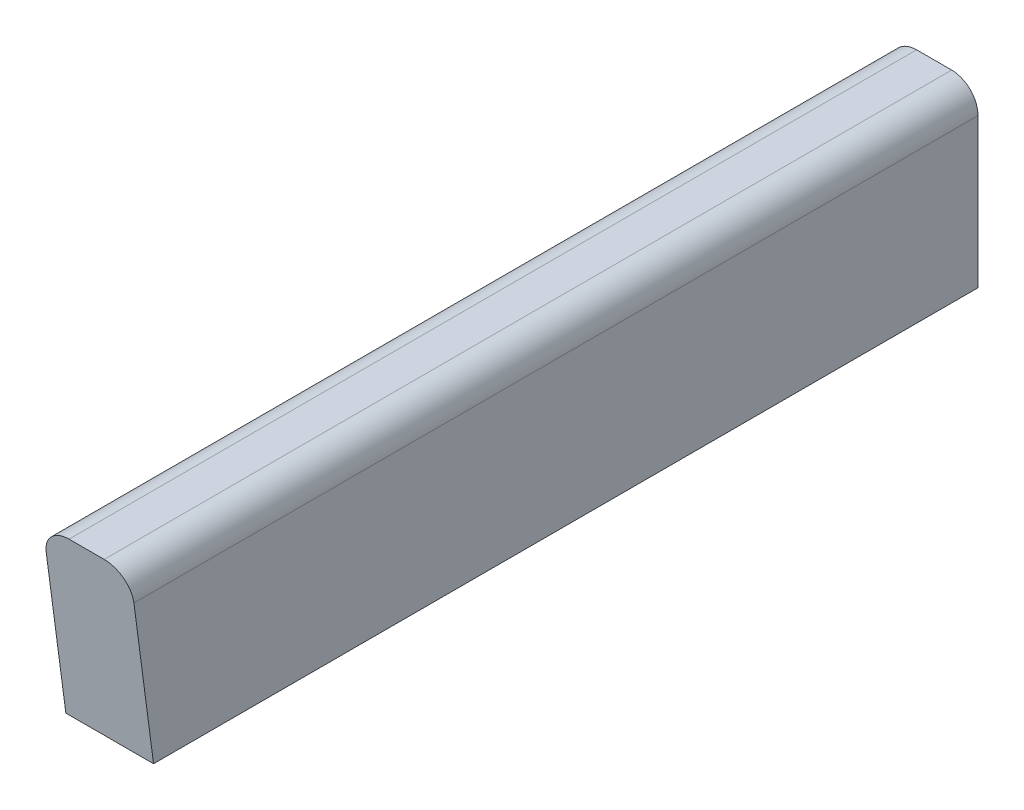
ISO-10303-21;
HEADER;
FILE_DESCRIPTION(('STEP AP214'),'2;1');
FILE_NAME('part.step','',(''),(''),'','','');
FILE_SCHEMA(('AUTOMOTIVE_DESIGN { 1 0 10303 214 1 1 1 1 }'));
ENDSEC;
DATA;
#1=APPLICATION_CONTEXT('core data for automotive mechanical design processes');
#2=APPLICATION_PROTOCOL_DEFINITION('international standard','automotive_design',2000,#1);
#3=PRODUCT_CONTEXT('',#1,'mechanical');
#4=PRODUCT('Part','Part','',(#3));
#5=PRODUCT_RELATED_PRODUCT_CATEGORY('part','',(#4));
#6=PRODUCT_DEFINITION_FORMATION('','',#4);
#7=PRODUCT_DEFINITION_CONTEXT('part definition',#1,'design');
#8=PRODUCT_DEFINITION('design','',#6,#7);
#9=PRODUCT_DEFINITION_SHAPE('','',#8);
#10=(LENGTH_UNIT() NAMED_UNIT(*) SI_UNIT(.MILLI.,.METRE.));
#11=(NAMED_UNIT(*) PLANE_ANGLE_UNIT() SI_UNIT($,.RADIAN.));
#12=(NAMED_UNIT(*) SI_UNIT($,.STERADIAN.) SOLID_ANGLE_UNIT());
#13=UNCERTAINTY_MEASURE_WITH_UNIT(LENGTH_MEASURE(1.E-05),#10,'distance_accuracy_value','');
#14=(GEOMETRIC_REPRESENTATION_CONTEXT(3) GLOBAL_UNCERTAINTY_ASSIGNED_CONTEXT((#13)) GLOBAL_UNIT_ASSIGNED_CONTEXT((#10,
#11,#12)) REPRESENTATION_CONTEXT('',''));
#15=CARTESIAN_POINT('',(0.,0.,0.));
#16=DIRECTION('',(0.,0.,1.));
#17=DIRECTION('',(1.,0.,0.));
#18=AXIS2_PLACEMENT_3D('',#15,#16,#17);
#19=CARTESIAN_POINT('',(0.,0.,117.783596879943));
#20=DIRECTION('',(1.,0.,0.));
#21=DIRECTION('',(0.,0.,-1.));
#22=AXIS2_PLACEMENT_3D('',#19,#20,#21);
#23=PLANE('',#22);
#24=DIRECTION('',(0.,-0.991444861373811,-0.130526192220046));
#25=VECTOR('',#24,1.);
#26=CARTESIAN_POINT('',(0.,3.07654050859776,94.4149516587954));
#27=LINE('',#26,#25);
#28=CARTESIAN_POINT('',(0.,17.,96.2480098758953));
#29=VERTEX_POINT('',#28);
#30=CARTESIAN_POINT('',(0.,0.,94.0099174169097));
#31=VERTEX_POINT('',#30);
#32=EDGE_CURVE('E114',#29,#31,#27,.T.);
#33=ORIENTED_EDGE('',*,*,#32,.F.);
#34=DIRECTION('',(0.,0.,-1.));
#35=VECTOR('',#34,1.);
#36=CARTESIAN_POINT('',(0.,17.,117.783596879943));
#37=LINE('',#36,#35);
#38=CARTESIAN_POINT('',(0.,17.,0.));
#39=VERTEX_POINT('',#38);
#40=EDGE_CURVE('E37',#29,#39,#37,.T.);
#41=ORIENTED_EDGE('',*,*,#40,.T.);
#42=DIRECTION('',(0.,-1.,0.));
#43=VECTOR('',#42,1.);
#44=CARTESIAN_POINT('',(0.,0.,0.));
#45=LINE('',#44,#43);
#46=CARTESIAN_POINT('',(0.,0.,0.));
#47=VERTEX_POINT('',#46);
#48=EDGE_CURVE('E122',#39,#47,#45,.T.);
#49=ORIENTED_EDGE('',*,*,#48,.T.);
#50=DIRECTION('',(0.,0.,-1.));
#51=VECTOR('',#50,1.);
#52=CARTESIAN_POINT('',(0.,0.,117.783596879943));
#53=LINE('',#52,#51);
#54=EDGE_CURVE('E80',#31,#47,#53,.T.);
#55=ORIENTED_EDGE('',*,*,#54,.F.);
#56=EDGE_LOOP('',(#33,#41,#49,#55));
#57=FACE_BOUND('',#56,.T.);
#58=ADVANCED_FACE('F33',(#57),#23,.F.);
#59=CARTESIAN_POINT('',(0.,0.,117.783596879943));
#60=DIRECTION('',(0.,1.,0.));
#61=DIRECTION('',(0.,0.,1.));
#62=AXIS2_PLACEMENT_3D('',#59,#60,#61);
#63=PLANE('',#62);
#64=DIRECTION('',(1.,0.,0.));
#65=VECTOR('',#64,1.);
#66=CARTESIAN_POINT('',(0.,0.,94.0099174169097));
#67=LINE('',#66,#65);
#68=CARTESIAN_POINT('',(10.,0.,94.0099174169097));
#69=VERTEX_POINT('',#68);
#70=EDGE_CURVE('E87',#31,#69,#67,.T.);
#71=ORIENTED_EDGE('',*,*,#70,.F.);
#72=ORIENTED_EDGE('',*,*,#54,.T.);
#73=DIRECTION('',(1.,0.,0.));
#74=VECTOR('',#73,1.);
#75=CARTESIAN_POINT('',(0.,0.,0.));
#76=LINE('',#75,#74);
#77=CARTESIAN_POINT('',(10.,0.,0.));
#78=VERTEX_POINT('',#77);
#79=EDGE_CURVE('E121',#47,#78,#76,.T.);
#80=ORIENTED_EDGE('',*,*,#79,.T.);
#81=DIRECTION('',(0.,0.,-1.));
#82=VECTOR('',#81,1.);
#83=CARTESIAN_POINT('',(10.,0.,117.783596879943));
#84=LINE('',#83,#82);
#85=EDGE_CURVE('E123',#69,#78,#84,.T.);
#86=ORIENTED_EDGE('',*,*,#85,.F.);
#87=EDGE_LOOP('',(#71,#72,#80,#86));
#88=FACE_BOUND('',#87,.T.);
#89=ADVANCED_FACE('F141',(#88),#63,.F.);
#90=CARTESIAN_POINT('',(10.,0.,117.783596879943));
#91=DIRECTION('',(-1.,0.,0.));
#92=DIRECTION('',(0.,0.,1.));
#93=AXIS2_PLACEMENT_3D('',#90,#91,#92);
#94=PLANE('',#93);
#95=DIRECTION('',(0.,0.991444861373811,0.130526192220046));
#96=VECTOR('',#95,1.);
#97=CARTESIAN_POINT('',(10.,3.07654050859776,94.4149516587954));
#98=LINE('',#97,#96);
#99=CARTESIAN_POINT('',(10.,17.,96.2480098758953));
#100=VERTEX_POINT('',#99);
#101=EDGE_CURVE('E108',#69,#100,#98,.T.);
#102=ORIENTED_EDGE('',*,*,#101,.F.);
#103=ORIENTED_EDGE('',*,*,#85,.T.);
#104=DIRECTION('',(0.,1.,0.));
#105=VECTOR('',#104,1.);
#106=CARTESIAN_POINT('',(10.,0.,0.));
#107=LINE('',#106,#105);
#108=CARTESIAN_POINT('',(10.,17.,0.));
#109=VERTEX_POINT('',#108);
#110=EDGE_CURVE('E125',#78,#109,#107,.T.);
#111=ORIENTED_EDGE('',*,*,#110,.T.);
#112=DIRECTION('',(0.,0.,-1.));
#113=VECTOR('',#112,1.);
#114=CARTESIAN_POINT('',(10.,17.,117.783596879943));
#115=LINE('',#114,#113);
#116=EDGE_CURVE('E126',#100,#109,#115,.T.);
#117=ORIENTED_EDGE('',*,*,#116,.F.);
#118=EDGE_LOOP('',(#102,#103,#111,#117));
#119=FACE_BOUND('',#118,.T.);
#120=ADVANCED_FACE('F143',(#119),#94,.F.);
#121=CARTESIAN_POINT('',(7.,17.,117.783596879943));
#122=DIRECTION('',(0.,0.,-1.));
#123=DIRECTION('',(-1.,0.,0.));
#124=AXIS2_PLACEMENT_3D('',#121,#122,#123);
#125=CYLINDRICAL_SURFACE('',#124,3.);
#126=CARTESIAN_POINT('',(7.,17.,96.2480098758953));
#127=DIRECTION('',(0.,-0.130526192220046,0.991444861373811));
#128=DIRECTION('',(0.,-0.991444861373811,-0.130526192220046));
#129=AXIS2_PLACEMENT_3D('',#126,#127,#128);
#130=ELLIPSE('',#129,3.02588688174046,3.);
#131=CARTESIAN_POINT('',(6.99999999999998,20.,96.6429673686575));
#132=VERTEX_POINT('',#131);
#133=EDGE_CURVE('E42',#100,#132,#130,.T.);
#134=ORIENTED_EDGE('',*,*,#133,.F.);
#135=ORIENTED_EDGE('',*,*,#116,.T.);
#136=CARTESIAN_POINT('',(7.,17.,0.));
#137=DIRECTION('',(0.,0.,1.));
#138=DIRECTION('',(1.,0.,0.));
#139=AXIS2_PLACEMENT_3D('',#136,#137,#138);
#140=CIRCLE('',#139,3.);
#141=CARTESIAN_POINT('',(6.99999999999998,20.,0.));
#142=VERTEX_POINT('',#141);
#143=EDGE_CURVE('E103',#109,#142,#140,.T.);
#144=ORIENTED_EDGE('',*,*,#143,.T.);
#145=DIRECTION('',(0.,0.,-1.));
#146=VECTOR('',#145,1.);
#147=CARTESIAN_POINT('',(6.99999999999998,20.,117.783596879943));
#148=LINE('',#147,#146);
#149=EDGE_CURVE('E94',#132,#142,#148,.T.);
#150=ORIENTED_EDGE('',*,*,#149,.F.);
#151=EDGE_LOOP('',(#134,#135,#144,#150));
#152=FACE_BOUND('',#151,.T.);
#153=ADVANCED_FACE('F100',(#152),#125,.T.);
#154=CARTESIAN_POINT('',(3.00000000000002,20.,117.783596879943));
#155=DIRECTION('',(0.,-1.,0.));
#156=DIRECTION('',(0.,0.,-1.));
#157=AXIS2_PLACEMENT_3D('',#154,#155,#156);
#158=PLANE('',#157);
#159=DIRECTION('',(-1.,0.,0.));
#160=VECTOR('',#159,1.);
#161=CARTESIAN_POINT('',(3.00000000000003,20.,96.6429673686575));
#162=LINE('',#161,#160);
#163=CARTESIAN_POINT('',(3.00000000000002,20.,96.6429673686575));
#164=VERTEX_POINT('',#163);
#165=EDGE_CURVE('E11',#132,#164,#162,.T.);
#166=ORIENTED_EDGE('',*,*,#165,.F.);
#167=ORIENTED_EDGE('',*,*,#149,.T.);
#168=DIRECTION('',(-1.,0.,0.));
#169=VECTOR('',#168,1.);
#170=CARTESIAN_POINT('',(3.00000000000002,20.,0.));
#171=LINE('',#170,#169);
#172=CARTESIAN_POINT('',(3.00000000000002,20.,0.));
#173=VERTEX_POINT('',#172);
#174=EDGE_CURVE('E105',#142,#173,#171,.T.);
#175=ORIENTED_EDGE('',*,*,#174,.T.);
#176=DIRECTION('',(0.,0.,-1.));
#177=VECTOR('',#176,1.);
#178=CARTESIAN_POINT('',(3.00000000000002,20.,117.783596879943));
#179=LINE('',#178,#177);
#180=EDGE_CURVE('E55',#164,#173,#179,.T.);
#181=ORIENTED_EDGE('',*,*,#180,.F.);
#182=EDGE_LOOP('',(#166,#167,#175,#181));
#183=FACE_BOUND('',#182,.T.);
#184=ADVANCED_FACE('F93',(#183),#158,.F.);
#185=CARTESIAN_POINT('',(3.,17.,117.783596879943));
#186=DIRECTION('',(0.,0.,-1.));
#187=DIRECTION('',(-1.,0.,0.));
#188=AXIS2_PLACEMENT_3D('',#185,#186,#187);
#189=CYLINDRICAL_SURFACE('',#188,3.);
#190=CARTESIAN_POINT('',(3.,17.,96.2480098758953));
#191=DIRECTION('',(0.,-0.130526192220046,0.991444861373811));
#192=DIRECTION('',(0.,-0.991444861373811,-0.130526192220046));
#193=AXIS2_PLACEMENT_3D('',#190,#191,#192);
#194=ELLIPSE('',#193,3.02588688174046,3.);
#195=EDGE_CURVE('E117',#164,#29,#194,.T.);
#196=ORIENTED_EDGE('',*,*,#195,.F.);
#197=ORIENTED_EDGE('',*,*,#180,.T.);
#198=CARTESIAN_POINT('',(3.,17.,0.));
#199=DIRECTION('',(0.,0.,1.));
#200=DIRECTION('',(-1.,0.,0.));
#201=AXIS2_PLACEMENT_3D('',#198,#199,#200);
#202=CIRCLE('',#201,3.);
#203=EDGE_CURVE('E119',#173,#39,#202,.T.);
#204=ORIENTED_EDGE('',*,*,#203,.T.);
#205=ORIENTED_EDGE('',*,*,#40,.F.);
#206=EDGE_LOOP('',(#196,#197,#204,#205));
#207=FACE_BOUND('',#206,.T.);
#208=ADVANCED_FACE('F137',(#207),#189,.T.);
#209=CARTESIAN_POINT('',(3.,17.,0.));
#210=DIRECTION('',(0.,0.,-1.));
#211=DIRECTION('',(-1.,0.,0.));
#212=AXIS2_PLACEMENT_3D('',#209,#210,#211);
#213=PLANE('',#212);
#214=ORIENTED_EDGE('',*,*,#48,.F.);
#215=ORIENTED_EDGE('',*,*,#203,.F.);
#216=ORIENTED_EDGE('',*,*,#174,.F.);
#217=ORIENTED_EDGE('',*,*,#143,.F.);
#218=ORIENTED_EDGE('',*,*,#110,.F.);
#219=ORIENTED_EDGE('',*,*,#79,.F.);
#220=EDGE_LOOP('',(#214,#215,#216,#217,#218,#219));
#221=FACE_BOUND('',#220,.T.);
#222=ADVANCED_FACE('F139',(#221),#213,.T.);
#223=CARTESIAN_POINT('',(50.,-5.84880387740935,93.23990777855));
#224=DIRECTION('',(0.,-0.130526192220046,0.991444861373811));
#225=DIRECTION('',(0.,-0.991444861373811,-0.130526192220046));
#226=AXIS2_PLACEMENT_3D('',#223,#224,#225);
#227=PLANE('',#226);
#228=ORIENTED_EDGE('',*,*,#195,.T.);
#229=ORIENTED_EDGE('',*,*,#32,.T.);
#230=ORIENTED_EDGE('',*,*,#70,.T.);
#231=ORIENTED_EDGE('',*,*,#101,.T.);
#232=ORIENTED_EDGE('',*,*,#133,.T.);
#233=ORIENTED_EDGE('',*,*,#165,.T.);
#234=EDGE_LOOP('',(#228,#229,#230,#231,#232,#233));
#235=FACE_BOUND('',#234,.T.);
#236=ADVANCED_FACE('F35',(#235),#227,.T.);
#237=CLOSED_SHELL('',(#58,#89,#120,#153,#184,#208,#222,#236));
#238=MANIFOLD_SOLID_BREP('B2',#237);
#239=ADVANCED_BREP_SHAPE_REPRESENTATION('',(#18,#238),#14);
#240=SHAPE_DEFINITION_REPRESENTATION(#9,#239);
ENDSEC;
END-ISO-10303-21;
